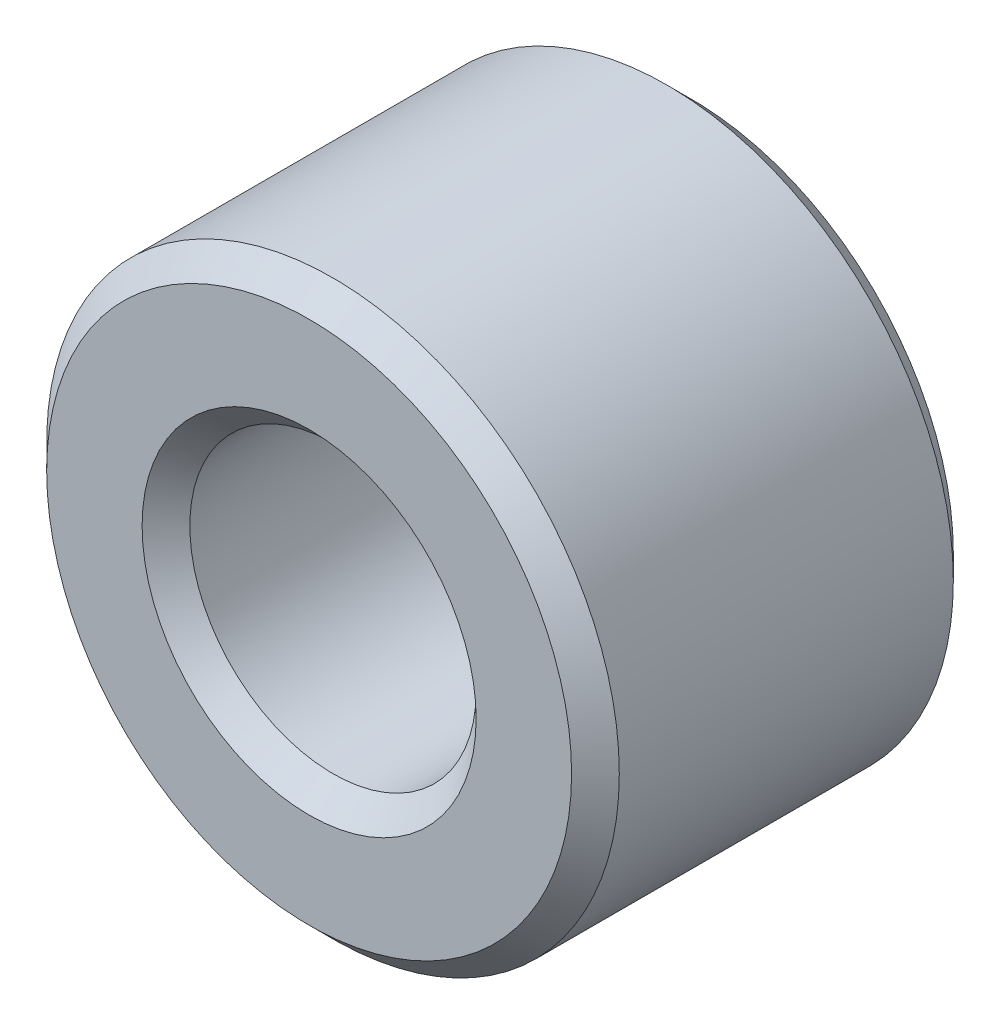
ISO-10303-21;
HEADER;
FILE_DESCRIPTION(('STEP AP214'),'2;1');
FILE_NAME('part.step','',(''),(''),'','','');
FILE_SCHEMA(('AUTOMOTIVE_DESIGN { 1 0 10303 214 1 1 1 1 }'));
ENDSEC;
DATA;
#1=APPLICATION_CONTEXT('core data for automotive mechanical design processes');
#2=APPLICATION_PROTOCOL_DEFINITION('international standard','automotive_design',2000,#1);
#3=PRODUCT_CONTEXT('',#1,'mechanical');
#4=PRODUCT('Part','Part','',(#3));
#5=PRODUCT_RELATED_PRODUCT_CATEGORY('part','',(#4));
#6=PRODUCT_DEFINITION_FORMATION('','',#4);
#7=PRODUCT_DEFINITION_CONTEXT('part definition',#1,'design');
#8=PRODUCT_DEFINITION('design','',#6,#7);
#9=PRODUCT_DEFINITION_SHAPE('','',#8);
#10=(LENGTH_UNIT() NAMED_UNIT(*) SI_UNIT(.MILLI.,.METRE.));
#11=(NAMED_UNIT(*) PLANE_ANGLE_UNIT() SI_UNIT($,.RADIAN.));
#12=(NAMED_UNIT(*) SI_UNIT($,.STERADIAN.) SOLID_ANGLE_UNIT());
#13=UNCERTAINTY_MEASURE_WITH_UNIT(LENGTH_MEASURE(1.E-05),#10,'distance_accuracy_value','');
#14=(GEOMETRIC_REPRESENTATION_CONTEXT(3) GLOBAL_UNCERTAINTY_ASSIGNED_CONTEXT((#13)) GLOBAL_UNIT_ASSIGNED_CONTEXT((#10,
#11,#12)) REPRESENTATION_CONTEXT('',''));
#15=CARTESIAN_POINT('',(0.,0.,0.));
#16=DIRECTION('',(0.,0.,1.));
#17=DIRECTION('',(1.,0.,0.));
#18=AXIS2_PLACEMENT_3D('',#15,#16,#17);
#19=CARTESIAN_POINT('',(0.,0.,4.));
#20=DIRECTION('',(0.,0.,1.));
#21=DIRECTION('',(1.,0.,0.));
#22=AXIS2_PLACEMENT_3D('',#19,#20,#21);
#23=PLANE('',#22);
#24=CARTESIAN_POINT('',(0.,0.,4.));
#25=DIRECTION('',(0.,0.,1.));
#26=DIRECTION('',(1.,0.,0.));
#27=AXIS2_PLACEMENT_3D('',#24,#25,#26);
#28=CIRCLE('',#27,2.75);
#29=CARTESIAN_POINT('',(2.75,0.,4.));
#30=VERTEX_POINT('',#29);
#31=EDGE_CURVE('E41',#30,#30,#28,.T.);
#32=ORIENTED_EDGE('',*,*,#31,.T.);
#33=EDGE_LOOP('',(#32));
#34=FACE_BOUND('',#33,.T.);
#35=CARTESIAN_POINT('',(0.,0.,4.));
#36=DIRECTION('',(0.,0.,1.));
#37=DIRECTION('',(1.,0.,0.));
#38=AXIS2_PLACEMENT_3D('',#35,#36,#37);
#39=CIRCLE('',#38,1.75);
#40=CARTESIAN_POINT('',(1.75,0.,4.));
#41=VERTEX_POINT('',#40);
#42=EDGE_CURVE('E45',#41,#41,#39,.F.);
#43=ORIENTED_EDGE('',*,*,#42,.T.);
#44=EDGE_LOOP('',(#43));
#45=FACE_BOUND('',#44,.T.);
#46=ADVANCED_FACE('F30',(#34,#45),#23,.T.);
#47=CARTESIAN_POINT('',(0.,0.,0.));
#48=DIRECTION('',(0.,0.,1.));
#49=DIRECTION('',(1.,0.,0.));
#50=AXIS2_PLACEMENT_3D('',#47,#48,#49);
#51=PLANE('',#50);
#52=CARTESIAN_POINT('',(0.,0.,0.));
#53=DIRECTION('',(0.,0.,1.));
#54=DIRECTION('',(1.,0.,0.));
#55=AXIS2_PLACEMENT_3D('',#52,#53,#54);
#56=CIRCLE('',#55,2.75);
#57=CARTESIAN_POINT('',(2.75,0.,0.));
#58=VERTEX_POINT('',#57);
#59=EDGE_CURVE('E50',#58,#58,#56,.F.);
#60=ORIENTED_EDGE('',*,*,#59,.T.);
#61=EDGE_LOOP('',(#60));
#62=FACE_BOUND('',#61,.T.);
#63=CARTESIAN_POINT('',(0.,0.,0.));
#64=DIRECTION('',(0.,0.,1.));
#65=DIRECTION('',(1.,0.,0.));
#66=AXIS2_PLACEMENT_3D('',#63,#64,#65);
#67=CIRCLE('',#66,1.75);
#68=CARTESIAN_POINT('',(1.75,0.,0.));
#69=VERTEX_POINT('',#68);
#70=EDGE_CURVE('E53',#69,#69,#67,.T.);
#71=ORIENTED_EDGE('',*,*,#70,.T.);
#72=EDGE_LOOP('',(#71));
#73=FACE_BOUND('',#72,.T.);
#74=ADVANCED_FACE('F75',(#62,#73),#51,.F.);
#75=CARTESIAN_POINT('',(0.,0.,4.));
#76=DIRECTION('',(0.,0.,-1.));
#77=DIRECTION('',(-1.,0.,0.));
#78=AXIS2_PLACEMENT_3D('',#75,#76,#77);
#79=CYLINDRICAL_SURFACE('',#78,3.);
#80=CARTESIAN_POINT('',(0.,0.,0.25));
#81=DIRECTION('',(0.,0.,1.));
#82=DIRECTION('',(1.,0.,0.));
#83=AXIS2_PLACEMENT_3D('',#80,#81,#82);
#84=CIRCLE('',#83,3.);
#85=CARTESIAN_POINT('',(3.,0.,0.25));
#86=VERTEX_POINT('',#85);
#87=EDGE_CURVE('E56',#86,#86,#84,.T.);
#88=ORIENTED_EDGE('',*,*,#87,.T.);
#89=EDGE_LOOP('',(#88));
#90=FACE_BOUND('',#89,.T.);
#91=CARTESIAN_POINT('',(0.,0.,3.75));
#92=DIRECTION('',(0.,0.,1.));
#93=DIRECTION('',(1.,0.,0.));
#94=AXIS2_PLACEMENT_3D('',#91,#92,#93);
#95=CIRCLE('',#94,3.);
#96=CARTESIAN_POINT('',(3.,0.,3.75));
#97=VERTEX_POINT('',#96);
#98=EDGE_CURVE('E59',#97,#97,#95,.F.);
#99=ORIENTED_EDGE('',*,*,#98,.T.);
#100=EDGE_LOOP('',(#99));
#101=FACE_BOUND('',#100,.T.);
#102=ADVANCED_FACE('F63',(#90,#101),#79,.T.);
#103=CARTESIAN_POINT('',(0.,0.,4.));
#104=DIRECTION('',(0.,0.,-1.));
#105=DIRECTION('',(-1.,0.,0.));
#106=AXIS2_PLACEMENT_3D('',#103,#104,#105);
#107=CYLINDRICAL_SURFACE('',#106,1.5);
#108=CARTESIAN_POINT('',(0.,0.,0.250000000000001));
#109=DIRECTION('',(0.,0.,1.));
#110=DIRECTION('',(1.,0.,0.));
#111=AXIS2_PLACEMENT_3D('',#108,#109,#110);
#112=CIRCLE('',#111,1.5);
#113=CARTESIAN_POINT('',(1.5,0.,0.250000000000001));
#114=VERTEX_POINT('',#113);
#115=EDGE_CURVE('E10',#114,#114,#112,.F.);
#116=ORIENTED_EDGE('',*,*,#115,.T.);
#117=EDGE_LOOP('',(#116));
#118=FACE_BOUND('',#117,.T.);
#119=CARTESIAN_POINT('',(0.,0.,3.75));
#120=DIRECTION('',(0.,0.,1.));
#121=DIRECTION('',(1.,0.,0.));
#122=AXIS2_PLACEMENT_3D('',#119,#120,#121);
#123=CIRCLE('',#122,1.5);
#124=CARTESIAN_POINT('',(1.5,0.,3.75));
#125=VERTEX_POINT('',#124);
#126=EDGE_CURVE('E37',#125,#125,#123,.T.);
#127=ORIENTED_EDGE('',*,*,#126,.T.);
#128=EDGE_LOOP('',(#127));
#129=FACE_BOUND('',#128,.T.);
#130=ADVANCED_FACE('F91',(#118,#129),#107,.F.);
#131=CARTESIAN_POINT('',(0.,0.,0.25));
#132=DIRECTION('',(0.,0.,1.));
#133=DIRECTION('',(1.,0.,0.));
#134=AXIS2_PLACEMENT_3D('',#131,#132,#133);
#135=CONICAL_SURFACE('',#134,3.,0.785398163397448);
#136=ORIENTED_EDGE('',*,*,#59,.F.);
#137=EDGE_LOOP('',(#136));
#138=FACE_BOUND('',#137,.T.);
#139=ORIENTED_EDGE('',*,*,#87,.F.);
#140=EDGE_LOOP('',(#139));
#141=FACE_BOUND('',#140,.T.);
#142=ADVANCED_FACE('F69',(#138,#141),#135,.T.);
#143=CARTESIAN_POINT('',(0.,0.,4.));
#144=DIRECTION('',(0.,0.,-1.));
#145=DIRECTION('',(-1.,0.,0.));
#146=AXIS2_PLACEMENT_3D('',#143,#144,#145);
#147=CONICAL_SURFACE('',#146,2.75,0.785398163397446);
#148=ORIENTED_EDGE('',*,*,#98,.F.);
#149=EDGE_LOOP('',(#148));
#150=FACE_BOUND('',#149,.T.);
#151=ORIENTED_EDGE('',*,*,#31,.F.);
#152=EDGE_LOOP('',(#151));
#153=FACE_BOUND('',#152,.T.);
#154=ADVANCED_FACE('F65',(#150,#153),#147,.T.);
#155=CARTESIAN_POINT('',(0.,0.,0.));
#156=DIRECTION('',(0.,0.,-1.));
#157=DIRECTION('',(-1.,0.,0.));
#158=AXIS2_PLACEMENT_3D('',#155,#156,#157);
#159=CONICAL_SURFACE('',#158,1.75,0.785398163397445);
#160=ORIENTED_EDGE('',*,*,#115,.F.);
#161=EDGE_LOOP('',(#160));
#162=FACE_BOUND('',#161,.T.);
#163=ORIENTED_EDGE('',*,*,#70,.F.);
#164=EDGE_LOOP('',(#163));
#165=FACE_BOUND('',#164,.T.);
#166=ADVANCED_FACE('F68',(#162,#165),#159,.F.);
#167=CARTESIAN_POINT('',(0.,0.,3.75));
#168=DIRECTION('',(0.,0.,1.));
#169=DIRECTION('',(1.,0.,0.));
#170=AXIS2_PLACEMENT_3D('',#167,#168,#169);
#171=CONICAL_SURFACE('',#170,1.5,0.78539816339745);
#172=ORIENTED_EDGE('',*,*,#42,.F.);
#173=EDGE_LOOP('',(#172));
#174=FACE_BOUND('',#173,.T.);
#175=ORIENTED_EDGE('',*,*,#126,.F.);
#176=EDGE_LOOP('',(#175));
#177=FACE_BOUND('',#176,.T.);
#178=ADVANCED_FACE('F32',(#174,#177),#171,.F.);
#179=CLOSED_SHELL('',(#46,#74,#102,#130,#142,#154,#166,#178));
#180=MANIFOLD_SOLID_BREP('B2',#179);
#181=ADVANCED_BREP_SHAPE_REPRESENTATION('',(#18,#180),#14);
#182=SHAPE_DEFINITION_REPRESENTATION(#9,#181);
ENDSEC;
END-ISO-10303-21;
